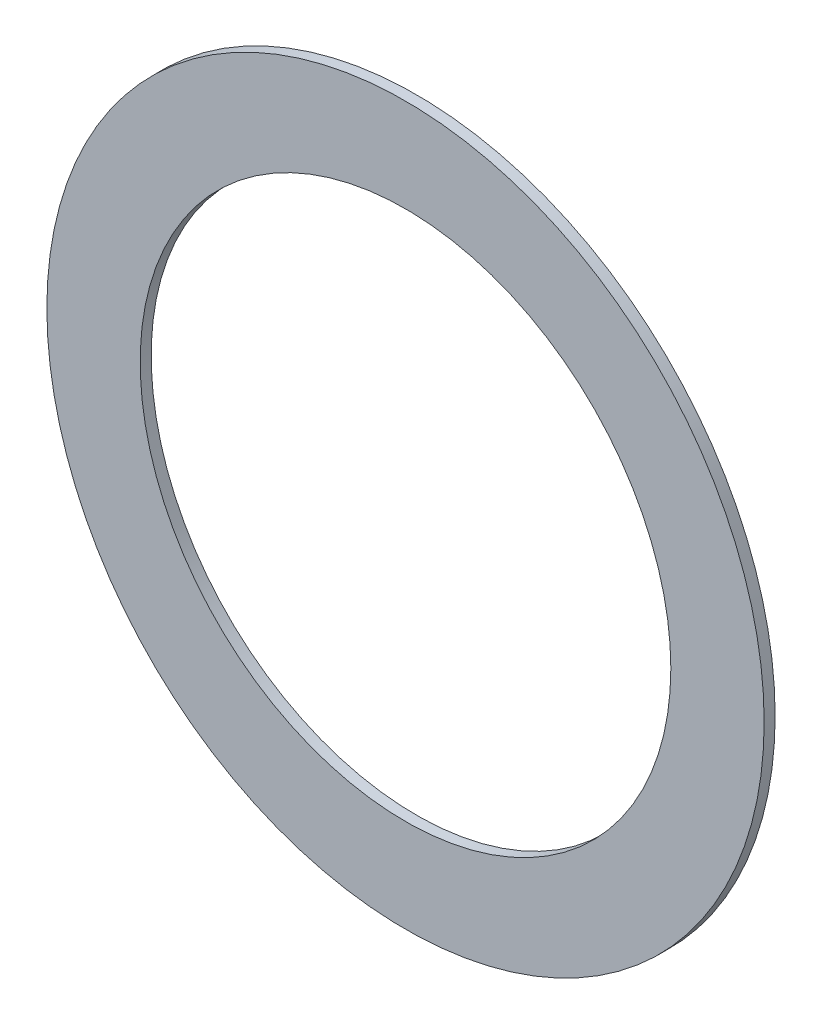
from build123d import *

# Parameters (mm, degrees)
SKETCH_1_R      = 9.8
SKETCH_1_R_2    = 7.25
EXTRUDE_1_DEPTH = 0.3


with BuildPart() as part:
    # Sketch 1 → Extrude 1 (new body)
    with BuildSketch(Plane.XY):
        Circle(SKETCH_1_R)
        Circle(SKETCH_1_R_2, mode=Mode.SUBTRACT)
    extrude(amount=EXTRUDE_1_DEPTH)


solid = part.part
